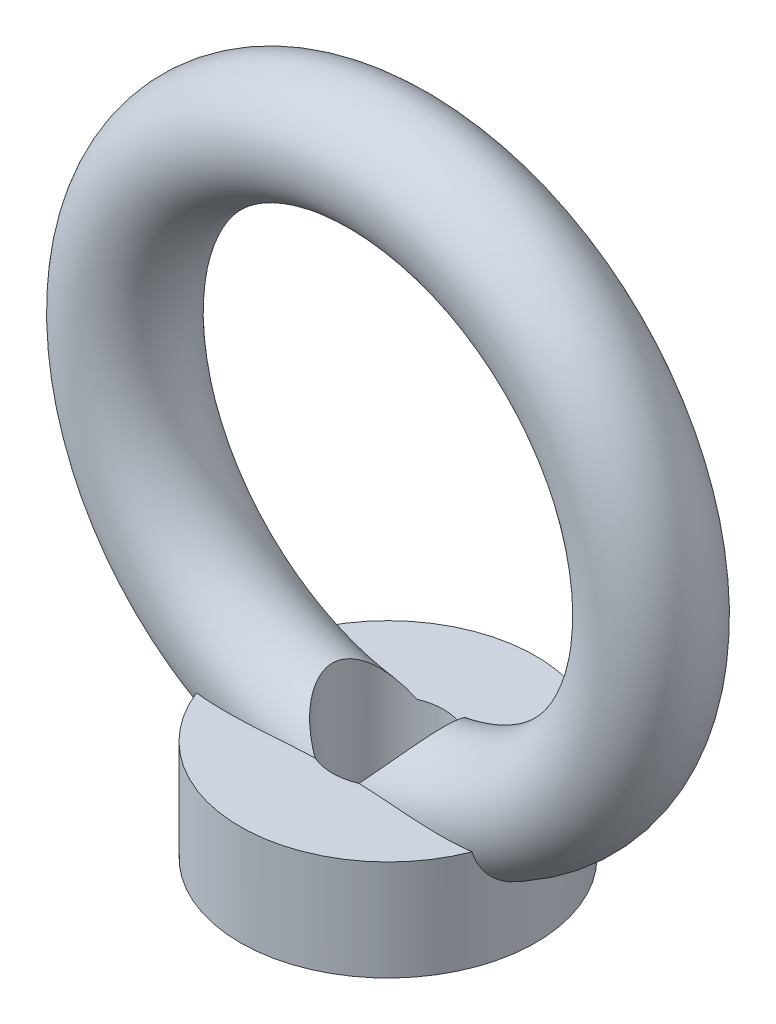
ISO-10303-21;
HEADER;
FILE_DESCRIPTION(('STEP AP214'),'2;1');
FILE_NAME('part.step','',(''),(''),'','','');
FILE_SCHEMA(('AUTOMOTIVE_DESIGN { 1 0 10303 214 1 1 1 1 }'));
ENDSEC;
DATA;
#1=APPLICATION_CONTEXT('core data for automotive mechanical design processes');
#2=APPLICATION_PROTOCOL_DEFINITION('international standard','automotive_design',2000,#1);
#3=PRODUCT_CONTEXT('',#1,'mechanical');
#4=PRODUCT('Part','Part','',(#3));
#5=PRODUCT_RELATED_PRODUCT_CATEGORY('part','',(#4));
#6=PRODUCT_DEFINITION_FORMATION('','',#4);
#7=PRODUCT_DEFINITION_CONTEXT('part definition',#1,'design');
#8=PRODUCT_DEFINITION('design','',#6,#7);
#9=PRODUCT_DEFINITION_SHAPE('','',#8);
#10=(LENGTH_UNIT() NAMED_UNIT(*) SI_UNIT(.MILLI.,.METRE.));
#11=(NAMED_UNIT(*) PLANE_ANGLE_UNIT() SI_UNIT($,.RADIAN.));
#12=(NAMED_UNIT(*) SI_UNIT($,.STERADIAN.) SOLID_ANGLE_UNIT());
#13=UNCERTAINTY_MEASURE_WITH_UNIT(LENGTH_MEASURE(1.E-05),#10,'distance_accuracy_value','');
#14=(GEOMETRIC_REPRESENTATION_CONTEXT(3) GLOBAL_UNCERTAINTY_ASSIGNED_CONTEXT((#13)) GLOBAL_UNIT_ASSIGNED_CONTEXT((#10,
#11,#12)) REPRESENTATION_CONTEXT('',''));
#15=CARTESIAN_POINT('',(0.,0.,0.));
#16=DIRECTION('',(0.,0.,1.));
#17=DIRECTION('',(1.,0.,0.));
#18=AXIS2_PLACEMENT_3D('',#15,#16,#17);
#19=CARTESIAN_POINT('',(0.,17.272,0.));
#20=DIRECTION('',(0.,1.,0.));
#21=DIRECTION('',(0.,0.,1.));
#22=AXIS2_PLACEMENT_3D('',#19,#20,#21);
#23=PLANE('',#22);
#24=CARTESIAN_POINT('',(0.,17.272,0.));
#25=DIRECTION('',(0.,1.,0.));
#26=DIRECTION('',(0.,0.,1.));
#27=AXIS2_PLACEMENT_3D('',#24,#25,#26);
#28=CIRCLE('',#27,9.525);
#29=CARTESIAN_POINT('',(3.75295136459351,17.272,-8.75448348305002));
#30=VERTEX_POINT('',#29);
#31=CARTESIAN_POINT('',(-3.75295136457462,17.272,-8.75448348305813));
#32=VERTEX_POINT('',#31);
#33=EDGE_CURVE('E401',#30,#32,#28,.T.);
#34=ORIENTED_EDGE('',*,*,#33,.F.);
#35=CARTESIAN_POINT('',(0.,17.272,8.67954019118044));
#36=CARTESIAN_POINT('',(0.395993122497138,17.272,8.679538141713));
#37=CARTESIAN_POINT('',(0.791984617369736,17.272,8.68212215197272));
#38=CARTESIAN_POINT('',(1.58390188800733,17.272,8.69236349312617));
#39=CARTESIAN_POINT('',(1.97982766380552,17.272,8.70002082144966));
#40=CARTESIAN_POINT('',(2.77156534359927,17.272,8.72014953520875));
#41=CARTESIAN_POINT('',(3.16737724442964,17.272,8.73262104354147));
#42=CARTESIAN_POINT('',(3.95883761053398,17.272,8.7619436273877));
#43=CARTESIAN_POINT('',(4.35448607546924,17.272,8.77879471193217));
#44=CARTESIAN_POINT('',(5.54184245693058,17.272,8.83512557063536));
#45=CARTESIAN_POINT('',(6.33327542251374,17.272,8.88036371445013));
#46=CARTESIAN_POINT('',(7.91552120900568,17.272,8.9801593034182));
#47=CARTESIAN_POINT('',(8.70633402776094,17.272,9.03471678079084));
#48=CARTESIAN_POINT('',(10.2926590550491,17.272,9.14600665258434));
#49=CARTESIAN_POINT('',(11.0881704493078,17.272,9.20275030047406));
#50=CARTESIAN_POINT('',(12.6797086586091,17.272,9.30960993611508));
#51=CARTESIAN_POINT('',(13.4757355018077,17.272,9.35972552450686));
#52=CARTESIAN_POINT('',(15.0678391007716,17.272,9.44415051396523));
#53=CARTESIAN_POINT('',(15.8639148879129,17.272,9.47847680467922));
#54=CARTESIAN_POINT('',(17.4566874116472,17.272,9.52167726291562));
#55=CARTESIAN_POINT('',(18.2533839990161,17.272,9.53055633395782));
#56=CARTESIAN_POINT('',(19.857317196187,17.272,9.51224237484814));
#57=CARTESIAN_POINT('',(20.664551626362,17.272,9.48456317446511));
#58=CARTESIAN_POINT('',(21.8733622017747,17.272,9.40618067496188));
#59=CARTESIAN_POINT('',(22.2761431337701,17.272,9.37388594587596));
#60=CARTESIAN_POINT('',(23.0803536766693,17.272,9.29529044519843));
#61=CARTESIAN_POINT('',(23.4817833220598,17.272,9.24899003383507));
#62=CARTESIAN_POINT('',(24.2795508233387,17.272,9.14098205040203));
#63=CARTESIAN_POINT('',(24.6759043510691,17.272,9.07939149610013));
#64=CARTESIAN_POINT('',(25.4655686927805,17.272,8.93871246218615));
#65=CARTESIAN_POINT('',(25.8588792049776,17.272,8.85962226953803));
#66=CARTESIAN_POINT('',(26.6405605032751,17.272,8.68199599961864));
#67=CARTESIAN_POINT('',(27.0289372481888,17.272,8.58348635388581));
#68=CARTESIAN_POINT('',(27.7994589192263,17.272,8.36474424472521));
#69=CARTESIAN_POINT('',(28.1816059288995,17.272,8.24451921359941));
#70=CARTESIAN_POINT('',(28.8293566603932,17.272,8.01777405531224));
#71=CARTESIAN_POINT('',(29.0970343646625,17.272,7.91716787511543));
#72=CARTESIAN_POINT('',(29.6270514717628,17.272,7.70271881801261));
#73=CARTESIAN_POINT('',(29.8893911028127,17.272,7.58887650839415));
#74=CARTESIAN_POINT('',(30.4078787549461,17.272,7.34681104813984));
#75=CARTESIAN_POINT('',(30.6640164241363,17.272,7.21856563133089));
#76=CARTESIAN_POINT('',(31.1681357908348,17.272,6.94686946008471));
#77=CARTESIAN_POINT('',(31.416117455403,17.272,6.80341864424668));
#78=CARTESIAN_POINT('',(31.9042184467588,17.272,6.49902405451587));
#79=CARTESIAN_POINT('',(32.1442483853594,17.272,6.33793623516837));
#80=CARTESIAN_POINT('',(32.6118248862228,17.272,5.99842444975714));
#81=CARTESIAN_POINT('',(32.8393701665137,17.272,5.81999870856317));
#82=CARTESIAN_POINT('',(33.2788199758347,17.272,5.44543822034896));
#83=CARTESIAN_POINT('',(33.4907493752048,17.272,5.2493327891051));
#84=CARTESIAN_POINT('',(33.8960745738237,17.272,4.83882661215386));
#85=CARTESIAN_POINT('',(34.0894779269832,17.272,4.62443339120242));
#86=CARTESIAN_POINT('',(34.4011791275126,17.272,4.24231888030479));
#87=CARTESIAN_POINT('',(34.5249964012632,17.272,4.07908470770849));
#88=CARTESIAN_POINT('',(34.7599555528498,17.272,3.74375452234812));
#89=CARTESIAN_POINT('',(34.8711007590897,17.272,3.57166085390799));
#90=CARTESIAN_POINT('',(35.0792206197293,17.272,3.21908392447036));
#91=CARTESIAN_POINT('',(35.1761954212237,17.272,3.03860075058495));
#92=CARTESIAN_POINT('',(35.3544095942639,17.272,2.67010546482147));
#93=CARTESIAN_POINT('',(35.4356566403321,17.272,2.48209707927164));
#94=CARTESIAN_POINT('',(35.581656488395,17.272,2.09789034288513));
#95=CARTESIAN_POINT('',(35.6462605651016,17.272,1.90163522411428));
#96=CARTESIAN_POINT('',(35.7567467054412,17.272,1.50390020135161));
#97=CARTESIAN_POINT('',(35.8026286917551,17.272,1.30242027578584));
#98=CARTESIAN_POINT('',(35.8746464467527,17.272,0.896070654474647));
#99=CARTESIAN_POINT('',(35.9007938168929,17.272,0.691203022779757));
#100=CARTESIAN_POINT('',(35.9327789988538,17.272,0.279896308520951));
#101=CARTESIAN_POINT('',(35.9386192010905,17.272,0.0734574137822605));
#102=CARTESIAN_POINT('',(35.9303969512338,17.272,-0.313981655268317));
#103=CARTESIAN_POINT('',(35.9186588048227,17.272,-0.495035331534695));
#104=CARTESIAN_POINT('',(35.8796179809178,17.272,-0.855457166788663));
#105=CARTESIAN_POINT('',(35.8523153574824,17.272,-1.03482533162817));
#106=CARTESIAN_POINT('',(35.7826240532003,17.272,-1.39059712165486));
#107=CARTESIAN_POINT('',(35.7402351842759,17.272,-1.56700070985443));
#108=CARTESIAN_POINT('',(35.6410798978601,17.272,-1.91571193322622));
#109=CARTESIAN_POINT('',(35.5843128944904,17.272,-2.08801940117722));
#110=CARTESIAN_POINT('',(35.4574833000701,17.272,-2.42702001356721));
#111=CARTESIAN_POINT('',(35.3874647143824,17.272,-2.59372964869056));
#112=CARTESIAN_POINT('',(35.2349967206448,17.272,-2.92138279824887));
#113=CARTESIAN_POINT('',(35.1525429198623,17.272,-3.08232425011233));
#114=CARTESIAN_POINT('',(34.8880983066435,17.272,-3.55548769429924));
#115=CARTESIAN_POINT('',(34.6889330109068,17.272,-3.85828708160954));
#116=CARTESIAN_POINT('',(34.3083333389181,17.272,-4.36273545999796));
#117=CARTESIAN_POINT('',(34.1350268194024,17.272,-4.57067752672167));
#118=CARTESIAN_POINT('',(33.7707292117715,17.272,-4.970535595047));
#119=CARTESIAN_POINT('',(33.5797311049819,17.272,-5.16244517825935));
#120=CARTESIAN_POINT('',(32.9835986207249,17.272,-5.71506180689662));
#121=CARTESIAN_POINT('',(32.5560048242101,17.272,-6.05178814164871));
#122=CARTESIAN_POINT('',(31.7702408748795,17.272,-6.58986002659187));
#123=CARTESIAN_POINT('',(31.4206365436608,17.272,-6.80418114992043));
#124=CARTESIAN_POINT('',(30.7038259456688,17.272,-7.20148686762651));
#125=CARTESIAN_POINT('',(30.3366106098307,17.272,-7.38445508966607));
#126=CARTESIAN_POINT('',(29.5898252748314,17.272,-7.721456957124));
#127=CARTESIAN_POINT('',(29.2102707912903,17.272,-7.87552540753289));
#128=CARTESIAN_POINT('',(28.4417631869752,17.272,-8.15779886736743));
#129=CARTESIAN_POINT('',(28.0528107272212,17.272,-8.28600568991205));
#130=CARTESIAN_POINT('',(27.3027865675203,17.272,-8.5088592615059));
#131=CARTESIAN_POINT('',(26.9422921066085,17.272,-8.60547148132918));
#132=CARTESIAN_POINT('',(26.2170311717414,17.272,-8.78124756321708));
#133=CARTESIAN_POINT('',(25.8522639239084,17.272,-8.86040821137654));
#134=CARTESIAN_POINT('',(25.1194744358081,17.272,-9.00301266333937));
#135=CARTESIAN_POINT('',(24.7514504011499,17.272,-9.06644716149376));
#136=CARTESIAN_POINT('',(24.0132320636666,17.272,-9.17913514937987));
#137=CARTESIAN_POINT('',(23.6430376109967,17.272,-9.22838764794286));
#138=CARTESIAN_POINT('',(22.8985573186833,17.272,-9.31449034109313));
#139=CARTESIAN_POINT('',(22.5242611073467,17.272,-9.35124982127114));
#140=CARTESIAN_POINT('',(21.7747082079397,17.272,-9.41329040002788));
#141=CARTESIAN_POINT('',(21.3994514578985,17.272,-9.43857073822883));
#142=CARTESIAN_POINT('',(20.6485167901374,17.272,-9.4789639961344));
#143=CARTESIAN_POINT('',(20.2728390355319,17.272,-9.49408001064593));
#144=CARTESIAN_POINT('',(19.5213202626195,17.272,-9.51539253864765));
#145=CARTESIAN_POINT('',(19.1454792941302,17.272,-9.52159089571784));
#146=CARTESIAN_POINT('',(17.8907403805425,17.272,-9.52939304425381));
#147=CARTESIAN_POINT('',(17.0117339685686,17.272,-9.51374705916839));
#148=CARTESIAN_POINT('',(15.254639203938,17.272,-9.45419302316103));
#149=CARTESIAN_POINT('',(14.3765511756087,17.272,-9.41027709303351));
#150=CARTESIAN_POINT('',(12.6202003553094,17.272,-9.30690412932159));
#151=CARTESIAN_POINT('',(11.7419388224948,17.272,-9.24742694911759));
#152=CARTESIAN_POINT('',(9.98575416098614,17.272,-9.1249547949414));
#153=CARTESIAN_POINT('',(9.10783100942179,17.272,-9.06196012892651));
#154=CARTESIAN_POINT('',(7.79000939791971,17.272,-8.97293040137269));
#155=CARTESIAN_POINT('',(7.35030254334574,17.272,-8.94414782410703));
#156=CARTESIAN_POINT('',(6.47070202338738,17.272,-8.88961917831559));
#157=CARTESIAN_POINT('',(6.03080835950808,17.272,-8.86387308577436));
#158=CARTESIAN_POINT('',(5.15079927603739,17.272,-8.81650267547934));
#159=CARTESIAN_POINT('',(4.71068385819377,17.272,-8.79487832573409));
#160=CARTESIAN_POINT('',(3.83023226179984,17.272,-8.75665857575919));
#161=CARTESIAN_POINT('',(3.38989608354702,17.272,-8.74006316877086));
#162=CARTESIAN_POINT('',(2.50971974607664,17.272,-8.71262406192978));
#163=CARTESIAN_POINT('',(2.06987986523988,17.272,-8.70177155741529));
#164=CARTESIAN_POINT('',(1.19008986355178,17.272,-8.68623955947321));
#165=CARTESIAN_POINT('',(0.750139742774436,17.272,-8.68156006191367));
#166=CARTESIAN_POINT('',(-0.129776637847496,17.272,-8.6785733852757));
#167=CARTESIAN_POINT('',(-0.56974289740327,17.272,-8.6802661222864));
#168=CARTESIAN_POINT('',(-1.44960526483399,17.272,-8.68995159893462));
#169=CARTESIAN_POINT('',(-1.88950137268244,17.272,-8.69794434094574));
#170=CARTESIAN_POINT('',(-2.76556387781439,17.272,-8.71980074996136));
#171=CARTESIAN_POINT('',(-3.20173149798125,17.272,-8.7336161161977));
#172=CARTESIAN_POINT('',(-4.07386483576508,17.272,-8.76653540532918));
#173=CARTESIAN_POINT('',(-4.50983055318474,17.272,-8.78563933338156));
#174=CARTESIAN_POINT('',(-5.38155816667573,17.272,-8.82834892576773));
#175=CARTESIAN_POINT('',(-5.81732005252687,17.272,-8.8519547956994));
#176=CARTESIAN_POINT('',(-6.68864023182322,17.272,-8.90269079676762));
#177=CARTESIAN_POINT('',(-7.12419852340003,17.272,-8.92982095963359));
#178=CARTESIAN_POINT('',(-8.43261583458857,17.272,-9.01497907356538));
#179=CARTESIAN_POINT('',(-9.30523042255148,17.272,-9.07666757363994));
#180=CARTESIAN_POINT('',(-11.0504541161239,17.272,-9.19948631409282));
#181=CARTESIAN_POINT('',(-11.9230632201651,17.272,-9.2606165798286));
#182=CARTESIAN_POINT('',(-13.664798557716,17.272,-9.37052416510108));
#183=CARTESIAN_POINT('',(-14.533920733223,17.272,-9.41936094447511));
#184=CARTESIAN_POINT('',(-16.2734686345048,17.272,-9.492886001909));
#185=CARTESIAN_POINT('',(-17.1438946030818,17.272,-9.51756901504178));
#186=CARTESIAN_POINT('',(-18.8827888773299,17.272,-9.52957879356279));
#187=CARTESIAN_POINT('',(-19.7512556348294,17.272,-9.51701253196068));
#188=CARTESIAN_POINT('',(-21.0520215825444,17.272,-9.45944076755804));
#189=CARTESIAN_POINT('',(-21.4851842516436,17.272,-9.43380723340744));
#190=CARTESIAN_POINT('',(-22.3503504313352,17.272,-9.36763062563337));
#191=CARTESIAN_POINT('',(-22.7823540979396,17.272,-9.327089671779));
#192=CARTESIAN_POINT('',(-23.4606442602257,17.272,-9.24987971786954));
#193=CARTESIAN_POINT('',(-23.7075886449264,17.272,-9.21892845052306));
#194=CARTESIAN_POINT('',(-24.2007042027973,17.272,-9.15097312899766));
#195=CARTESIAN_POINT('',(-24.4468751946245,17.272,-9.11396774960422));
#196=CARTESIAN_POINT('',(-24.9383815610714,17.272,-9.03342070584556));
#197=CARTESIAN_POINT('',(-25.1837159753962,17.272,-8.98987314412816));
#198=CARTESIAN_POINT('',(-25.6730251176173,17.272,-8.89579219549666));
#199=CARTESIAN_POINT('',(-25.9169999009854,17.272,-8.84525909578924));
#200=CARTESIAN_POINT('',(-26.6448251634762,17.272,-8.68279163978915));
#201=CARTESIAN_POINT('',(-27.1262623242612,17.272,-8.55972012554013));
#202=CARTESIAN_POINT('',(-28.0790340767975,17.272,-8.27962116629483));
#203=CARTESIAN_POINT('',(-28.5503739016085,17.272,-8.12261180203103));
#204=CARTESIAN_POINT('',(-29.3428431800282,17.272,-7.82146866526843));
#205=CARTESIAN_POINT('',(-29.6676338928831,17.272,-7.68696993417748));
#206=CARTESIAN_POINT('',(-30.307619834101,17.272,-7.39686230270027));
#207=CARTESIAN_POINT('',(-30.6228176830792,17.272,-7.24125923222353));
#208=CARTESIAN_POINT('',(-31.2410900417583,17.272,-6.90703519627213));
#209=CARTESIAN_POINT('',(-31.5441568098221,17.272,-6.72839982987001));
#210=CARTESIAN_POINT('',(-32.1343498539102,17.272,-6.34649271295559));
#211=CARTESIAN_POINT('',(-32.4214825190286,17.272,-6.14323094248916));
#212=CARTESIAN_POINT('',(-32.8914110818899,17.272,-5.77619795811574));
#213=CARTESIAN_POINT('',(-33.0794544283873,17.272,-5.61912864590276));
#214=CARTESIAN_POINT('',(-33.4439250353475,17.272,-5.29188894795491));
#215=CARTESIAN_POINT('',(-33.6203494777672,17.272,-5.12171540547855));
#216=CARTESIAN_POINT('',(-33.959197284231,17.272,-4.76841578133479));
#217=CARTESIAN_POINT('',(-34.1216417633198,17.272,-4.58531002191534));
#218=CARTESIAN_POINT('',(-34.4304521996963,17.272,-4.20611822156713));
#219=CARTESIAN_POINT('',(-34.5768282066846,17.272,-4.01004041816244));
#220=CARTESIAN_POINT('',(-34.8248074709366,17.272,-3.64413016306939));
#221=CARTESIAN_POINT('',(-34.9296156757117,17.272,-3.47646708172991));
#222=CARTESIAN_POINT('',(-35.1257466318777,17.272,-3.13350424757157));
#223=CARTESIAN_POINT('',(-35.2170759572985,17.272,-2.95820827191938));
#224=CARTESIAN_POINT('',(-35.3849414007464,17.272,-2.60064297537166));
#225=CARTESIAN_POINT('',(-35.4614771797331,17.272,-2.41837349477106));
#226=CARTESIAN_POINT('',(-35.5984688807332,17.272,-2.04786375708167));
#227=CARTESIAN_POINT('',(-35.6589246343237,17.272,-1.8596234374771));
#228=CARTESIAN_POINT('',(-35.7629673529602,17.272,-1.47721001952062));
#229=CARTESIAN_POINT('',(-35.8064427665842,17.272,-1.28300643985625));
#230=CARTESIAN_POINT('',(-35.8750817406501,17.272,-0.891375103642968));
#231=CARTESIAN_POINT('',(-35.9002452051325,17.272,-0.693947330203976));
#232=CARTESIAN_POINT('',(-35.9317156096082,17.272,-0.297662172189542));
#233=CARTESIAN_POINT('',(-35.9380294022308,17.272,-0.0988053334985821));
#234=CARTESIAN_POINT('',(-35.9316791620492,17.272,0.298594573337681));
#235=CARTESIAN_POINT('',(-35.9190166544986,17.272,0.497137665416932));
#236=CARTESIAN_POINT('',(-35.8773115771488,17.272,0.871381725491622));
#237=CARTESIAN_POINT('',(-35.8501274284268,17.272,1.04729325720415));
#238=CARTESIAN_POINT('',(-35.7812376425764,17.272,1.39630637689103));
#239=CARTESIAN_POINT('',(-35.7395271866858,17.272,1.56940701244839));
#240=CARTESIAN_POINT('',(-35.6422723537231,17.272,1.91160146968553));
#241=CARTESIAN_POINT('',(-35.5867325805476,17.272,2.08069660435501));
#242=CARTESIAN_POINT('',(-35.4626216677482,17.272,2.41408939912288));
#243=CARTESIAN_POINT('',(-35.3940456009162,17.272,2.57838521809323));
#244=CARTESIAN_POINT('',(-35.2416858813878,17.272,2.90813356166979));
#245=CARTESIAN_POINT('',(-35.1573866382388,17.272,3.07334772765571));
#246=CARTESIAN_POINT('',(-34.9767841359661,17.272,3.39710493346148));
#247=CARTESIAN_POINT('',(-34.8804762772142,17.272,3.55564538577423));
#248=CARTESIAN_POINT('',(-34.5752172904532,17.272,4.02054368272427));
#249=CARTESIAN_POINT('',(-34.3498711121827,17.272,4.31630472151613));
#250=CARTESIAN_POINT('',(-33.9166619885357,17.272,4.81706227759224));
#251=CARTESIAN_POINT('',(-33.7154120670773,17.272,5.02792205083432));
#252=CARTESIAN_POINT('',(-33.2950224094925,17.272,5.43116882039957));
#253=CARTESIAN_POINT('',(-33.0758745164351,17.272,5.62354730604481));
#254=CARTESIAN_POINT('',(-32.6225139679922,17.272,5.99055428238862));
#255=CARTESIAN_POINT('',(-32.3882704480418,17.272,6.16514439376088));
#256=CARTESIAN_POINT('',(-31.9078442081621,17.272,6.49690963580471));
#257=CARTESIAN_POINT('',(-31.6616617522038,17.272,6.6540851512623));
#258=CARTESIAN_POINT('',(-31.0199644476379,17.272,7.03482443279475));
#259=CARTESIAN_POINT('',(-30.6175083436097,17.272,7.24672566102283));
#260=CARTESIAN_POINT('',(-29.7956097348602,17.272,7.63458472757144));
#261=CARTESIAN_POINT('',(-29.3761570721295,17.272,7.81052067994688));
#262=CARTESIAN_POINT('',(-28.5249569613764,17.272,8.130279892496));
#263=CARTESIAN_POINT('',(-28.0932011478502,17.272,8.27408068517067));
#264=CARTESIAN_POINT('',(-27.2213801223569,17.272,8.53297075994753));
#265=CARTESIAN_POINT('',(-26.7813167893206,17.272,8.6480664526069));
#266=CARTESIAN_POINT('',(-25.7930508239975,17.272,8.87658220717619));
#267=CARTESIAN_POINT('',(-25.2433479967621,17.272,8.98347486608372));
#268=CARTESIAN_POINT('',(-24.1384750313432,17.272,9.16447620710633));
#269=CARTESIAN_POINT('',(-23.5833026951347,17.272,9.23857110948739));
#270=CARTESIAN_POINT('',(-22.4691057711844,17.272,9.35901348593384));
#271=CARTESIAN_POINT('',(-21.9100763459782,17.272,9.40531507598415));
#272=CARTESIAN_POINT('',(-20.7907050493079,17.272,9.4745027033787));
#273=CARTESIAN_POINT('',(-20.2303633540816,17.272,9.4973917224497));
#274=CARTESIAN_POINT('',(-19.1055339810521,17.272,9.52398256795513));
#275=CARTESIAN_POINT('',(-18.5410435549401,17.272,9.52755553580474));
#276=CARTESIAN_POINT('',(-17.4121988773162,17.272,9.51906184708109));
#277=CARTESIAN_POINT('',(-16.8478446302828,17.272,9.50699473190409));
#278=CARTESIAN_POINT('',(-15.7200031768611,17.272,9.47088121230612));
#279=CARTESIAN_POINT('',(-15.1565156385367,17.272,9.4468445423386));
#280=CARTESIAN_POINT('',(-14.0299617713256,17.272,9.39024088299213));
#281=CARTESIAN_POINT('',(-13.4668954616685,17.272,9.35767352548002));
#282=CARTESIAN_POINT('',(-12.3648175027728,17.272,9.28877773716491));
#283=CARTESIAN_POINT('',(-11.8257919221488,17.272,9.2526655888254));
#284=CARTESIAN_POINT('',(-10.7478939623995,17.272,9.17838974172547));
#285=CARTESIAN_POINT('',(-10.209021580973,17.272,9.14022607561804));
#286=CARTESIAN_POINT('',(-9.13113317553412,17.272,9.06445752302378));
#287=CARTESIAN_POINT('',(-8.59211714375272,17.272,9.02685274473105));
#288=CARTESIAN_POINT('',(-7.51388088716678,17.272,8.9546467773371));
#289=CARTESIAN_POINT('',(-6.97466066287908,17.272,8.92004558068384));
#290=CARTESIAN_POINT('',(-5.89948907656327,17.272,8.85624756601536));
#291=CARTESIAN_POINT('',(-5.36353979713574,17.272,8.82701637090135));
#292=CARTESIAN_POINT('',(-4.29130256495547,17.272,8.77549353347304));
#293=CARTESIAN_POINT('',(-3.75501461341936,17.272,8.75320186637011));
#294=CARTESIAN_POINT('',(-2.6823539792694,17.272,8.71695668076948));
#295=CARTESIAN_POINT('',(-2.14598140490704,17.272,8.70300002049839));
#296=CARTESIAN_POINT('',(-1.07307155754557,17.272,8.68429317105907));
#297=CARTESIAN_POINT('',(-0.536534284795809,17.272,8.67954296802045));
#298=CARTESIAN_POINT('',(0.,17.272,8.67954019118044));
#299=B_SPLINE_CURVE_WITH_KNOTS('',3,(#35,#36,#37,#38,#39,#40,#41,#42,#43,#44,#45,#46,#47,#48,
#49,#50,#51,#52,#53,#54,#55,#56,#57,#58,#59,#60,#61,#62,#63,#64,#65,#66,#67,#68,#69,#70,#71,#72,
#73,#74,#75,#76,#77,#78,#79,#80,#81,#82,#83,#84,#85,#86,#87,#88,#89,#90,#91,#92,#93,#94,#95,#96,
#97,#98,#99,#100,#101,#102,#103,#104,#105,#106,#107,#108,#109,#110,#111,#112,#113,#114,#115,
#116,#117,#118,#119,#120,#121,#122,#123,#124,#125,#126,#127,#128,#129,#130,#131,#132,#133,#134,
#135,#136,#137,#138,#139,#140,#141,#142,#143,#144,#145,#146,#147,#148,#149,#150,#151,#152,#153,
#154,#155,#156,#157,#158,#159,#160,#161,#162,#163,#164,#165,#166,#167,#168,#169,#170,#171,#172,
#173,#174,#175,#176,#177,#178,#179,#180,#181,#182,#183,#184,#185,#186,#187,#188,#189,#190,#191,
#192,#193,#194,#195,#196,#197,#198,#199,#200,#201,#202,#203,#204,#205,#206,#207,#208,#209,#210,
#211,#212,#213,#214,#215,#216,#217,#218,#219,#220,#221,#222,#223,#224,#225,#226,#227,#228,#229,
#230,#231,#232,#233,#234,#235,#236,#237,#238,#239,#240,#241,#242,#243,#244,#245,#246,#247,#248,
#249,#250,#251,#252,#253,#254,#255,#256,#257,#258,#259,#260,#261,#262,#263,#264,#265,#266,#267,
#268,#269,#270,#271,#272,#273,#274,#275,#276,#277,#278,#279,#280,#281,#282,#283,#284,#285,#286,
#287,#288,#289,#290,#291,#292,#293,#294,#295,#296,#297,#298),.UNSPECIFIED.,.T.,.F.,(4,2,2,2,2,2,
2,2,2,2,2,2,2,2,2,2,2,2,2,2,2,2,2,2,2,2,2,2,2,2,2,2,2,2,2,2,2,2,2,2,2,2,2,2,2,2,2,2,2,2,2,2,2,2,
2,2,2,2,2,2,2,2,2,2,2,2,2,2,2,2,2,2,2,2,2,2,2,2,2,2,2,2,2,2,2,2,2,2,2,2,2,2,2,2,2,2,2,2,2,2,2,2,
2,2,2,2,2,2,2,2,2,2,2,2,2,2,2,2,2,2,2,2,2,2,2,2,2,2,2,2,2,4),(0.,1.18796832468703,
2.37593604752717,3.56393409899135,4.75193460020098,7.12999381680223,9.50806125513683,
11.900661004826,14.2934048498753,16.6835832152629,19.0733009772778,21.4951205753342,
22.7071425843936,23.9191334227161,25.1221201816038,26.3252247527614,27.5267029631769,
28.7277707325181,29.5853413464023,30.4428752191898,31.3017535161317,32.1606352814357,
33.0271450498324,33.8937436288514,34.7589307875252,35.6237636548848,36.2378895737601,
36.8518538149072,37.4658116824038,38.0794692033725,38.6984338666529,39.3174010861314,
39.9360041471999,40.5545343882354,41.0981692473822,41.64180221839,42.1854419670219,
42.7291038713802,43.2709911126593,43.8130702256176,44.8964702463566,45.7075327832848,
46.5189184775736,48.1449557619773,49.3736803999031,50.6030447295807,51.8309188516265,
53.0587068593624,54.1778862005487,55.2972714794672,56.4173175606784,57.5374419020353,
58.665534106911,59.7937010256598,60.9215242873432,62.0491143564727,64.6857220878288,
67.3230649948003,69.9638394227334,72.6043830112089,73.9263186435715,75.2482438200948,
76.5701587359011,77.8920718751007,79.2119524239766,80.5318320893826,81.8516943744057,
83.1715571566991,84.4806802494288,85.7898046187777,87.0989887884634,88.4081847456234,
91.0325454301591,93.6567863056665,96.2680794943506,98.8799417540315,101.484310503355,
102.785870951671,104.087246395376,104.833812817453,105.580542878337,106.327950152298,
107.07532670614,108.564966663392,110.053814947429,111.107778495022,112.161451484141,
113.215786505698,114.26969566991,115.004191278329,115.738864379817,116.472407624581,
117.205489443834,117.7981149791,118.390450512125,118.982799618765,119.575154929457,
120.171338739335,120.767525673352,121.363495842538,121.959418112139,122.49280264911,
123.02636429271,123.559748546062,124.093334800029,124.649209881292,125.205298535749,
126.317060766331,127.190421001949,128.064181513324,128.939788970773,129.815377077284,
131.177677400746,132.540804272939,133.904881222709,135.268653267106,136.947424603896,
138.626900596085,140.309141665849,141.991168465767,143.684402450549,145.377686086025,
147.06959487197,148.761576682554,150.382269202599,152.002935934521,153.623912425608,
155.244884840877,156.855088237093,158.46528588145,160.074876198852,161.684464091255),.UNSPECIFIED.);
#300=CARTESIAN_POINT('',(23.6662597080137,17.272,-9.22323974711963));
#301=VERTEX_POINT('',#300);
#302=EDGE_CURVE('E432',#301,#30,#299,.T.);
#303=ORIENTED_EDGE('',*,*,#302,.F.);
#304=CARTESIAN_POINT('',(0.,17.272,0.));
#305=DIRECTION('',(0.,1.,0.));
#306=DIRECTION('',(0.,0.,1.));
#307=AXIS2_PLACEMENT_3D('',#304,#305,#306);
#308=CIRCLE('',#307,25.4);
#309=CARTESIAN_POINT('',(-23.6662597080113,17.272,-9.22323974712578));
#310=VERTEX_POINT('',#309);
#311=EDGE_CURVE('E444',#301,#310,#308,.T.);
#312=ORIENTED_EDGE('',*,*,#311,.T.);
#313=EDGE_CURVE('E442',#32,#310,#299,.T.);
#314=ORIENTED_EDGE('',*,*,#313,.F.);
#315=EDGE_LOOP('',(#34,#303,#312,#314));
#316=FACE_BOUND('',#315,.T.);
#317=ADVANCED_FACE('F381',(#316),#23,.T.);
#318=CARTESIAN_POINT('',(0.,17.272,0.));
#319=DIRECTION('',(0.,-1.,0.));
#320=DIRECTION('',(0.,0.,-1.));
#321=AXIS2_PLACEMENT_3D('',#318,#319,#320);
#322=CYLINDRICAL_SURFACE('',#321,25.4);
#323=ORIENTED_EDGE('',*,*,#311,.F.);
#324=CARTESIAN_POINT('',(23.6662413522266,17.2722,-9.22328684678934));
#325=CARTESIAN_POINT('',(23.6896815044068,17.016270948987,-9.16306871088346));
#326=CARTESIAN_POINT('',(23.7166306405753,16.7628526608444,-9.09330976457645));
#327=CARTESIAN_POINT('',(23.7769347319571,16.26283614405,-8.93448123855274));
#328=CARTESIAN_POINT('',(23.8102918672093,16.0162402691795,-8.84540508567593));
#329=CARTESIAN_POINT('',(23.8827659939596,15.5319576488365,-8.64780022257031));
#330=CARTESIAN_POINT('',(23.9218802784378,15.2942667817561,-8.53928064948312));
#331=CARTESIAN_POINT('',(24.0049212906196,14.8295772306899,-8.30297844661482));
#332=CARTESIAN_POINT('',(24.0488473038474,14.6025769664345,-8.17519867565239));
#333=CARTESIAN_POINT('',(24.1404813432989,14.1604281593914,-7.90051606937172));
#334=CARTESIAN_POINT('',(24.1881987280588,13.9453113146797,-7.75356530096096));
#335=CARTESIAN_POINT('',(24.2859871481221,13.5291655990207,-7.44160839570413));
#336=CARTESIAN_POINT('',(24.3360581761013,13.3281366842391,-7.2766023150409));
#337=CARTESIAN_POINT('',(24.4370958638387,12.9416913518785,-6.92971476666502));
#338=CARTESIAN_POINT('',(24.4880619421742,12.7562652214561,-6.74784394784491));
#339=CARTESIAN_POINT('',(24.5894643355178,12.4020737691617,-6.36842131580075));
#340=CARTESIAN_POINT('',(24.6399006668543,12.2333079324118,-6.17086998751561));
#341=CARTESIAN_POINT('',(24.7375348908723,11.9175620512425,-5.76683866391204));
#342=CARTESIAN_POINT('',(24.784782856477,11.7701303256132,-5.56072338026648));
#343=CARTESIAN_POINT('',(24.8761793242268,11.492725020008,-5.13641807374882));
#344=CARTESIAN_POINT('',(24.9203278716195,11.3627511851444,-4.91822822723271));
#345=CARTESIAN_POINT('',(25.0044022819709,11.1207940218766,-4.47119769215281));
#346=CARTESIAN_POINT('',(25.0443263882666,11.0088181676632,-4.24235262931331));
#347=CARTESIAN_POINT('',(25.1189199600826,10.8033800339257,-3.77567180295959));
#348=CARTESIAN_POINT('',(25.1535893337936,10.7099180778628,-3.53783588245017));
#349=CARTESIAN_POINT('',(25.2173879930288,10.5403297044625,-3.05038562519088));
#350=CARTESIAN_POINT('',(25.2464045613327,10.464550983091,-2.80063551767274));
#351=CARTESIAN_POINT('',(25.2973582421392,10.3328407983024,-2.29524925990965));
#352=CARTESIAN_POINT('',(25.3192952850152,10.2769095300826,-2.0396130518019));
#353=CARTESIAN_POINT('',(25.3555391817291,10.1850957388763,-1.52425447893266));
#354=CARTESIAN_POINT('',(25.3698466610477,10.1492115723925,-1.26453245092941));
#355=CARTESIAN_POINT('',(25.3904794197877,10.097607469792,-0.742778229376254));
#356=CARTESIAN_POINT('',(25.3968046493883,10.08188765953,-0.480746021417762));
#357=CARTESIAN_POINT('',(25.401346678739,10.0705902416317,0.0473478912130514));
#358=CARTESIAN_POINT('',(25.3994534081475,10.0752860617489,0.31341643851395));
#359=CARTESIAN_POINT('',(25.3873554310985,10.1054265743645,0.84418795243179));
#360=CARTESIAN_POINT('',(25.3771506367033,10.130871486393,1.10889090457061));
#361=CARTESIAN_POINT('',(25.34868715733,10.2024258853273,1.63508068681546));
#362=CARTESIAN_POINT('',(25.3304276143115,10.2485375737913,1.89656717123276));
#363=CARTESIAN_POINT('',(25.2863214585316,10.3612619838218,2.41443193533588));
#364=CARTESIAN_POINT('',(25.2604748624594,10.4278746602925,2.67081022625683));
#365=CARTESIAN_POINT('',(25.2018298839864,10.581441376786,3.17690725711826));
#366=CARTESIAN_POINT('',(25.1690236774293,10.6684183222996,3.42661814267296));
#367=CARTESIAN_POINT('',(25.0973401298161,10.8623315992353,3.91726840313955));
#368=CARTESIAN_POINT('',(25.058462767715,10.969267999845,4.15820774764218));
#369=CARTESIAN_POINT('',(24.9756847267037,11.2026325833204,4.62951576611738));
#370=CARTESIAN_POINT('',(24.9317847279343,11.329058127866,4.85988586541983));
#371=CARTESIAN_POINT('',(24.8401585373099,11.6008278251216,5.30838161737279));
#372=CARTESIAN_POINT('',(24.792432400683,11.7461717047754,5.52650744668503));
#373=CARTESIAN_POINT('',(24.6950195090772,12.0533605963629,5.94659626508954));
#374=CARTESIAN_POINT('',(24.6453596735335,12.2150092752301,6.14870905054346));
#375=CARTESIAN_POINT('',(24.5449843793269,12.5552018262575,6.53790010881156));
#376=CARTESIAN_POINT('',(24.4942689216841,12.7337456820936,6.72497839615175));
#377=CARTESIAN_POINT('',(24.3932081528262,13.1066585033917,7.08279424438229));
#378=CARTESIAN_POINT('',(24.3428628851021,13.3010292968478,7.25352991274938));
#379=CARTESIAN_POINT('',(24.2439756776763,13.7042665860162,7.57748888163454));
#380=CARTESIAN_POINT('',(24.1954336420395,13.9131323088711,7.73071311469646));
#381=CARTESIAN_POINT('',(24.1024458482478,14.3395381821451,8.01586890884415));
#382=CARTESIAN_POINT('',(24.05793752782,14.5568208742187,8.14816541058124));
#383=CARTESIAN_POINT('',(23.9730923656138,15.0023039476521,8.39451174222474));
#384=CARTESIAN_POINT('',(23.9327560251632,15.23050563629,8.50855938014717));
#385=CARTESIAN_POINT('',(23.8572870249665,15.6957224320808,8.71792561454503));
#386=CARTESIAN_POINT('',(23.8221465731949,15.9327236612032,8.81327232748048));
#387=CARTESIAN_POINT('',(23.7577503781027,16.414032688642,8.98541880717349));
#388=CARTESIAN_POINT('',(23.7284915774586,16.6583366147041,9.0622282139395));
#389=CARTESIAN_POINT('',(23.6959987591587,16.96622701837,9.1465815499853));
#390=CARTESIAN_POINT('',(23.6897710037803,17.027237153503,9.16269751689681));
#391=CARTESIAN_POINT('',(23.6777109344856,17.1495147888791,9.19381780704));
#392=CARTESIAN_POINT('',(23.6718782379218,17.2107819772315,9.20882320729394));
#393=CARTESIAN_POINT('',(23.6662413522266,17.2722,9.22328684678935));
#394=B_SPLINE_CURVE_WITH_KNOTS('',3,(#324,#325,#326,#327,#328,#329,#330,#331,#332,#333,#334,
#335,#336,#337,#338,#339,#340,#341,#342,#343,#344,#345,#346,#347,#348,#349,#350,#351,#352,#353,
#354,#355,#356,#357,#358,#359,#360,#361,#362,#363,#364,#365,#366,#367,#368,#369,#370,#371,#372,
#373,#374,#375,#376,#377,#378,#379,#380,#381,#382,#383,#384,#385,#386,#387,#388,#389,#390,#391,
#392,#393),.UNSPECIFIED.,.F.,.F.,(4,2,2,2,2,2,2,2,2,2,2,2,2,2,2,2,2,2,2,2,2,2,2,2,2,2,2,2,2,2,2,
2,2,2,4),(0.,0.791758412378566,1.58378666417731,2.37544368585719,3.16698331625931,
3.96054137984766,4.75409697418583,5.54715486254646,6.3401882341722,7.11264316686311,
7.88508682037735,8.65785042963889,9.43062753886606,10.217515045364,11.0044102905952,
11.7912410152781,12.5780766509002,13.3754826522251,14.1728970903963,14.9703964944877,
15.767894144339,16.5662931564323,17.3646949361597,18.1629887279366,18.9612709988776,
19.7508843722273,20.5404969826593,21.3302009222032,22.1198627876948,22.8937117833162,
23.6676536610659,24.440422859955,25.2127893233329,25.4030112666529,25.5930462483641),.UNSPECIFIED.);
#395=CARTESIAN_POINT('',(23.6662597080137,17.272,9.22323974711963));
#396=VERTEX_POINT('',#395);
#397=EDGE_CURVE('E452',#301,#396,#394,.T.);
#398=ORIENTED_EDGE('',*,*,#397,.T.);
#399=CARTESIAN_POINT('',(-23.6662597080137,17.272,9.22323974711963));
#400=VERTEX_POINT('',#399);
#401=EDGE_CURVE('E458',#400,#396,#308,.T.);
#402=ORIENTED_EDGE('',*,*,#401,.F.);
#403=CARTESIAN_POINT('',(-23.6662413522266,17.2722,9.22328684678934));
#404=CARTESIAN_POINT('',(-23.6896815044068,17.016270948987,9.16306871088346));
#405=CARTESIAN_POINT('',(-23.7166306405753,16.7628526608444,9.09330976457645));
#406=CARTESIAN_POINT('',(-23.7769347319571,16.26283614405,8.93448123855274));
#407=CARTESIAN_POINT('',(-23.8102918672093,16.0162402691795,8.84540508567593));
#408=CARTESIAN_POINT('',(-23.8827659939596,15.5319576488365,8.64780022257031));
#409=CARTESIAN_POINT('',(-23.9218802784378,15.2942667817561,8.53928064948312));
#410=CARTESIAN_POINT('',(-24.0049212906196,14.8295772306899,8.30297844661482));
#411=CARTESIAN_POINT('',(-24.0488473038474,14.6025769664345,8.17519867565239));
#412=CARTESIAN_POINT('',(-24.1404813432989,14.1604281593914,7.90051606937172));
#413=CARTESIAN_POINT('',(-24.1881987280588,13.9453113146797,7.75356530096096));
#414=CARTESIAN_POINT('',(-24.2859871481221,13.5291655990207,7.44160839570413));
#415=CARTESIAN_POINT('',(-24.3360581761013,13.3281366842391,7.2766023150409));
#416=CARTESIAN_POINT('',(-24.4370958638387,12.9416913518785,6.92971476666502));
#417=CARTESIAN_POINT('',(-24.4880619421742,12.7562652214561,6.74784394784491));
#418=CARTESIAN_POINT('',(-24.5894643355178,12.4020737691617,6.36842131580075));
#419=CARTESIAN_POINT('',(-24.6399006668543,12.2333079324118,6.17086998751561));
#420=CARTESIAN_POINT('',(-24.7375348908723,11.9175620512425,5.76683866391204));
#421=CARTESIAN_POINT('',(-24.784782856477,11.7701303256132,5.56072338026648));
#422=CARTESIAN_POINT('',(-24.8761793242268,11.492725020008,5.13641807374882));
#423=CARTESIAN_POINT('',(-24.9203278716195,11.3627511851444,4.91822822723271));
#424=CARTESIAN_POINT('',(-25.0044022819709,11.1207940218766,4.47119769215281));
#425=CARTESIAN_POINT('',(-25.0443263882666,11.0088181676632,4.24235262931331));
#426=CARTESIAN_POINT('',(-25.1189199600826,10.8033800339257,3.77567180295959));
#427=CARTESIAN_POINT('',(-25.1535893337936,10.7099180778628,3.53783588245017));
#428=CARTESIAN_POINT('',(-25.2173879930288,10.5403297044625,3.05038562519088));
#429=CARTESIAN_POINT('',(-25.2464045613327,10.464550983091,2.80063551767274));
#430=CARTESIAN_POINT('',(-25.2973582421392,10.3328407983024,2.29524925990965));
#431=CARTESIAN_POINT('',(-25.3192952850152,10.2769095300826,2.0396130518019));
#432=CARTESIAN_POINT('',(-25.3555391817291,10.1850957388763,1.52425447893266));
#433=CARTESIAN_POINT('',(-25.3698466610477,10.1492115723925,1.26453245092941));
#434=CARTESIAN_POINT('',(-25.3904794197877,10.097607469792,0.742778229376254));
#435=CARTESIAN_POINT('',(-25.3968046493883,10.08188765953,0.480746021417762));
#436=CARTESIAN_POINT('',(-25.401346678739,10.0705902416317,-0.0473478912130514));
#437=CARTESIAN_POINT('',(-25.3994534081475,10.0752860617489,-0.31341643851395));
#438=CARTESIAN_POINT('',(-25.3873554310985,10.1054265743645,-0.84418795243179));
#439=CARTESIAN_POINT('',(-25.3771506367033,10.130871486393,-1.10889090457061));
#440=CARTESIAN_POINT('',(-25.34868715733,10.2024258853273,-1.63508068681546));
#441=CARTESIAN_POINT('',(-25.3304276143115,10.2485375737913,-1.89656717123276));
#442=CARTESIAN_POINT('',(-25.2863214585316,10.3612619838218,-2.41443193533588));
#443=CARTESIAN_POINT('',(-25.2604748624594,10.4278746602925,-2.67081022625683));
#444=CARTESIAN_POINT('',(-25.2018298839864,10.581441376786,-3.17690725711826));
#445=CARTESIAN_POINT('',(-25.1690236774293,10.6684183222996,-3.42661814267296));
#446=CARTESIAN_POINT('',(-25.0973401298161,10.8623315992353,-3.91726840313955));
#447=CARTESIAN_POINT('',(-25.058462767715,10.969267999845,-4.15820774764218));
#448=CARTESIAN_POINT('',(-24.9756847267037,11.2026325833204,-4.62951576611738));
#449=CARTESIAN_POINT('',(-24.9317847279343,11.329058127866,-4.85988586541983));
#450=CARTESIAN_POINT('',(-24.8401585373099,11.6008278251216,-5.30838161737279));
#451=CARTESIAN_POINT('',(-24.792432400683,11.7461717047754,-5.52650744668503));
#452=CARTESIAN_POINT('',(-24.6950195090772,12.0533605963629,-5.94659626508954));
#453=CARTESIAN_POINT('',(-24.6453596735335,12.2150092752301,-6.14870905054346));
#454=CARTESIAN_POINT('',(-24.5449843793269,12.5552018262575,-6.53790010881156));
#455=CARTESIAN_POINT('',(-24.4942689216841,12.7337456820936,-6.72497839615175));
#456=CARTESIAN_POINT('',(-24.3932081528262,13.1066585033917,-7.08279424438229));
#457=CARTESIAN_POINT('',(-24.3428628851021,13.3010292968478,-7.25352991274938));
#458=CARTESIAN_POINT('',(-24.2439756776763,13.7042665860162,-7.57748888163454));
#459=CARTESIAN_POINT('',(-24.1954336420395,13.9131323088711,-7.73071311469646));
#460=CARTESIAN_POINT('',(-24.1024458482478,14.3395381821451,-8.01586890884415));
#461=CARTESIAN_POINT('',(-24.05793752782,14.5568208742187,-8.14816541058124));
#462=CARTESIAN_POINT('',(-23.9730923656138,15.0023039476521,-8.39451174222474));
#463=CARTESIAN_POINT('',(-23.9327560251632,15.23050563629,-8.50855938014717));
#464=CARTESIAN_POINT('',(-23.8572870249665,15.6957224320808,-8.71792561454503));
#465=CARTESIAN_POINT('',(-23.8221465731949,15.9327236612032,-8.81327232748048));
#466=CARTESIAN_POINT('',(-23.7577503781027,16.414032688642,-8.98541880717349));
#467=CARTESIAN_POINT('',(-23.7284915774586,16.6583366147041,-9.0622282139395));
#468=CARTESIAN_POINT('',(-23.6959987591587,16.96622701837,-9.1465815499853));
#469=CARTESIAN_POINT('',(-23.6897710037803,17.027237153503,-9.16269751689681));
#470=CARTESIAN_POINT('',(-23.6777109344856,17.1495147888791,-9.19381780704));
#471=CARTESIAN_POINT('',(-23.6718782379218,17.2107819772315,-9.20882320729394));
#472=CARTESIAN_POINT('',(-23.6662413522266,17.2722,-9.22328684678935));
#473=B_SPLINE_CURVE_WITH_KNOTS('',3,(#403,#404,#405,#406,#407,#408,#409,#410,#411,#412,#413,
#414,#415,#416,#417,#418,#419,#420,#421,#422,#423,#424,#425,#426,#427,#428,#429,#430,#431,#432,
#433,#434,#435,#436,#437,#438,#439,#440,#441,#442,#443,#444,#445,#446,#447,#448,#449,#450,#451,
#452,#453,#454,#455,#456,#457,#458,#459,#460,#461,#462,#463,#464,#465,#466,#467,#468,#469,#470,
#471,#472),.UNSPECIFIED.,.F.,.F.,(4,2,2,2,2,2,2,2,2,2,2,2,2,2,2,2,2,2,2,2,2,2,2,2,2,2,2,2,2,2,2,
2,2,2,4),(0.,0.791758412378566,1.58378666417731,2.37544368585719,3.16698331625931,
3.96054137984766,4.75409697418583,5.54715486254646,6.3401882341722,7.11264316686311,
7.88508682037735,8.65785042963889,9.43062753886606,10.217515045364,11.0044102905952,
11.7912410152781,12.5780766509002,13.3754826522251,14.1728970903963,14.9703964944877,
15.767894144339,16.5662931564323,17.3646949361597,18.1629887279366,18.9612709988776,
19.7508843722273,20.5404969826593,21.3302009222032,22.1198627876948,22.8937117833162,
23.6676536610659,24.440422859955,25.2127893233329,25.4030112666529,25.5930462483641),.UNSPECIFIED.);
#474=EDGE_CURVE('E441',#400,#310,#473,.T.);
#475=ORIENTED_EDGE('',*,*,#474,.T.);
#476=EDGE_LOOP('',(#323,#398,#402,#475));
#477=FACE_BOUND('',#476,.T.);
#478=CARTESIAN_POINT('',(0.,0.,0.));
#479=DIRECTION('',(0.,1.,0.));
#480=DIRECTION('',(0.,0.,1.));
#481=AXIS2_PLACEMENT_3D('',#478,#479,#480);
#482=CIRCLE('',#481,25.4);
#483=CARTESIAN_POINT('',(0.,0.,25.4));
#484=VERTEX_POINT('',#483);
#485=EDGE_CURVE('E459',#484,#484,#482,.T.);
#486=ORIENTED_EDGE('',*,*,#485,.T.);
#487=EDGE_LOOP('',(#486));
#488=FACE_BOUND('',#487,.T.);
#489=ADVANCED_FACE('F383',(#477,#488),#322,.T.);
#490=CARTESIAN_POINT('',(0.,17.272,0.));
#491=DIRECTION('',(0.,1.,0.));
#492=DIRECTION('',(0.,0.,1.));
#493=AXIS2_PLACEMENT_3D('',#490,#491,#492);
#494=CIRCLE('',#493,9.525);
#495=CARTESIAN_POINT('',(-3.75295136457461,17.272,8.75448348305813));
#496=VERTEX_POINT('',#495);
#497=CARTESIAN_POINT('',(3.75295136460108,17.272,8.75448348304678));
#498=VERTEX_POINT('',#497);
#499=EDGE_CURVE('E428',#496,#498,#494,.T.);
#500=ORIENTED_EDGE('',*,*,#499,.F.);
#501=EDGE_CURVE('E409',#400,#496,#299,.T.);
#502=ORIENTED_EDGE('',*,*,#501,.F.);
#503=ORIENTED_EDGE('',*,*,#401,.T.);
#504=EDGE_CURVE('E435',#498,#396,#299,.T.);
#505=ORIENTED_EDGE('',*,*,#504,.F.);
#506=EDGE_LOOP('',(#500,#502,#503,#505));
#507=FACE_BOUND('',#506,.T.);
#508=ADVANCED_FACE('F434',(#507),#23,.T.);
#509=CARTESIAN_POINT('',(0.,0.,0.));
#510=DIRECTION('',(0.,1.,0.));
#511=DIRECTION('',(0.,0.,1.));
#512=AXIS2_PLACEMENT_3D('',#509,#510,#511);
#513=PLANE('',#512);
#514=CARTESIAN_POINT('',(0.,0.,0.));
#515=DIRECTION('',(0.,-1.,0.));
#516=DIRECTION('',(0.,0.,-1.));
#517=AXIS2_PLACEMENT_3D('',#514,#515,#516);
#518=CIRCLE('',#517,9.525);
#519=CARTESIAN_POINT('',(0.,0.,-9.525));
#520=VERTEX_POINT('',#519);
#521=EDGE_CURVE('E436',#520,#520,#518,.T.);
#522=ORIENTED_EDGE('',*,*,#521,.F.);
#523=EDGE_LOOP('',(#522));
#524=FACE_BOUND('',#523,.T.);
#525=ORIENTED_EDGE('',*,*,#485,.F.);
#526=EDGE_LOOP('',(#525));
#527=FACE_BOUND('',#526,.T.);
#528=ADVANCED_FACE('F474',(#524,#527),#513,.F.);
#529=CARTESIAN_POINT('',(0.,58.5608371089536,0.));
#530=DIRECTION('',(0.,0.,1.));
#531=DIRECTION('',(1.,0.,0.));
#532=AXIS2_PLACEMENT_3D('',#529,#530,#531);
#533=TOROIDAL_SURFACE('',#532,45.212,9.525);
#534=CARTESIAN_POINT('',(0.,13.3488371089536,9.525));
#535=CARTESIAN_POINT('',(0.00460069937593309,13.3534378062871,9.52499999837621));
#536=CARTESIAN_POINT('',(0.00920107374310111,13.3580388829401,9.52499666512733));
#537=CARTESIAN_POINT('',(0.397294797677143,13.7462512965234,9.5244344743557));
#538=CARTESIAN_POINT('',(0.778509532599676,14.1324799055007,9.50073258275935));
#539=CARTESIAN_POINT('',(1.53335679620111,14.9073949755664,9.40846555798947));
#540=CARTESIAN_POINT('',(1.90698248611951,15.2960832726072,9.33986166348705));
#541=CARTESIAN_POINT('',(2.64494571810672,16.0742488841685,9.15831259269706));
#542=CARTESIAN_POINT('',(3.00925203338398,16.4637250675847,9.04523501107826));
#543=CARTESIAN_POINT('',(3.72465000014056,17.2392038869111,8.7748958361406));
#544=CARTESIAN_POINT('',(4.07574774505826,17.6252080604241,8.61765490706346));
#545=CARTESIAN_POINT('',(4.68129111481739,18.3003157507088,8.30053329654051));
#546=CARTESIAN_POINT('',(4.93904513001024,18.5908546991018,8.14997391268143));
#547=CARTESIAN_POINT('',(5.44386858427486,19.1660250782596,7.82180127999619));
#548=CARTESIAN_POINT('',(5.6909371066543,19.4506560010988,7.64418571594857));
#549=CARTESIAN_POINT('',(6.17201176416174,20.0108018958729,7.26128121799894));
#550=CARTESIAN_POINT('',(6.40604780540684,20.2863370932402,7.05605967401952));
#551=CARTESIAN_POINT('',(6.8594232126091,20.8256938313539,6.61616687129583));
#552=CARTESIAN_POINT('',(7.07876970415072,21.0895210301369,6.38151005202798));
#553=CARTESIAN_POINT('',(7.42161472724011,21.5060291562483,5.97389991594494));
#554=CARTESIAN_POINT('',(7.55045586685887,21.6635991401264,5.81039651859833));
#555=CARTESIAN_POINT('',(7.80021488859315,21.9709219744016,5.47053461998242));
#556=CARTESIAN_POINT('',(7.9211348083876,22.1206768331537,5.29417944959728));
#557=CARTESIAN_POINT('',(8.15385064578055,22.410565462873,4.92821472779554));
#558=CARTESIAN_POINT('',(8.26565294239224,22.5507059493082,4.73861461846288));
#559=CARTESIAN_POINT('',(8.4787566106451,22.8192658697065,4.34583631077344));
#560=CARTESIAN_POINT('',(8.58006074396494,22.947688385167,4.14266170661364));
#561=CARTESIAN_POINT('',(8.82013921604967,23.2535212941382,3.6129640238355));
#562=CARTESIAN_POINT('',(8.95103449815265,23.4217161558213,3.27720049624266));
#563=CARTESIAN_POINT('',(9.12073805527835,23.6409754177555,2.75167285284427));
#564=CARTESIAN_POINT('',(9.17285601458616,23.7085431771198,2.57289878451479));
#565=CARTESIAN_POINT('',(9.26731481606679,23.8312960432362,2.20858631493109));
#566=CARTESIAN_POINT('',(9.30965735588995,23.8864833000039,2.02304909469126));
#567=CARTESIAN_POINT('',(9.37779050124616,23.9754460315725,1.6759638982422));
#568=CARTESIAN_POINT('',(9.40513689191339,24.0112238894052,1.51523172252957));
#569=CARTESIAN_POINT('',(9.45171398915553,24.0722289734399,1.19062763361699));
#570=CARTESIAN_POINT('',(9.4709462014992,24.0974581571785,1.02675630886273));
#571=CARTESIAN_POINT('',(9.50090708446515,24.1367857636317,0.696984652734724));
#572=CARTESIAN_POINT('',(9.51163977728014,24.1508894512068,0.531085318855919));
#573=CARTESIAN_POINT('',(9.52438919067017,24.1676452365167,0.19836730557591));
#574=CARTESIAN_POINT('',(9.52640574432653,24.1702971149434,0.0315486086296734));
#575=CARTESIAN_POINT('',(9.52167673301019,24.1640806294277,-0.301833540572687));
#576=CARTESIAN_POINT('',(9.51492666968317,24.1552063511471,-0.468396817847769));
#577=CARTESIAN_POINT('',(9.49280360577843,24.1261470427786,-0.799944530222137));
#578=CARTESIAN_POINT('',(9.47743075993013,24.1059622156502,-0.96492899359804));
#579=CARTESIAN_POINT('',(9.4383685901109,24.0547426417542,-1.29228941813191));
#580=CARTESIAN_POINT('',(9.41467473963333,24.0237019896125,-1.45466390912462));
#581=CARTESIAN_POINT('',(9.35942255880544,23.9514478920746,-1.77578043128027));
#582=CARTESIAN_POINT('',(9.32786252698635,23.9102322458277,-1.93452166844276));
#583=CARTESIAN_POINT('',(9.24818167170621,23.8064027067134,-2.28860949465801));
#584=CARTESIAN_POINT('',(9.19788833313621,23.741011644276,-2.48265876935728));
#585=CARTESIAN_POINT('',(9.08680894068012,23.5970767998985,-2.86265185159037));
#586=CARTESIAN_POINT('',(9.0260203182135,23.518529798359,-3.0485936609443));
#587=CARTESIAN_POINT('',(8.82945680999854,23.265534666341,-3.59382500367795));
#588=CARTESIAN_POINT('',(8.6795585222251,23.0738299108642,-3.94020428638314));
#589=CARTESIAN_POINT('',(8.39473099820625,22.713058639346,-4.50850021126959));
#590=CARTESIAN_POINT('',(8.26651267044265,22.5516405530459,-4.73893529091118));
#591=CARTESIAN_POINT('',(7.99680946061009,22.2145881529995,-5.18108755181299));
#592=CARTESIAN_POINT('',(7.85531849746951,22.0389473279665,-5.39279606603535));
#593=CARTESIAN_POINT('',(7.56090396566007,21.6762777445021,-5.79838730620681));
#594=CARTESIAN_POINT('',(7.40796149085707,21.4892302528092,-5.99223932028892));
#595=CARTESIAN_POINT('',(7.09242994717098,21.1063882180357,-6.36256331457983));
#596=CARTESIAN_POINT('',(6.92984117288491,20.910593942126,-6.53903582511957));
#597=CARTESIAN_POINT('',(6.51239199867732,20.4119464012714,-6.95996762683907));
#598=CARTESIAN_POINT('',(6.25221870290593,20.1047339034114,-7.19403153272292));
#599=CARTESIAN_POINT('',(5.71604755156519,19.4794477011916,-7.6270042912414));
#600=CARTESIAN_POINT('',(5.44004174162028,19.1613685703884,-7.82589526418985));
#601=CARTESIAN_POINT('',(4.87449572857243,18.5176451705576,-8.19012224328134));
#602=CARTESIAN_POINT('',(4.5849448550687,18.191995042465,-8.35543122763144));
#603=CARTESIAN_POINT('',(3.99459219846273,17.5361434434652,-8.65321492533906));
#604=CARTESIAN_POINT('',(3.69379328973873,17.2059431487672,-8.78569796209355));
#605=CARTESIAN_POINT('',(3.11857300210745,16.5820734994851,-9.00462693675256));
#606=CARTESIAN_POINT('',(2.84521414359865,16.2886789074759,-9.09465614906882));
#607=CARTESIAN_POINT('',(2.29220569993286,15.7012875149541,-9.24953686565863));
#608=CARTESIAN_POINT('',(2.01255558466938,15.4072906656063,-9.3143862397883));
#609=CARTESIAN_POINT('',(1.16698995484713,14.527403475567,-9.4705640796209));
#610=CARTESIAN_POINT('',(0.592799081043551,13.9418158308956,-9.52415137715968));
#611=CARTESIAN_POINT('',(0.0092010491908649,13.3580388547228,-9.52499666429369));
#612=CARTESIAN_POINT('',(0.00460067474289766,13.3534377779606,-9.52499999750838));
#613=CARTESIAN_POINT('',(0.,13.3488371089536,-9.525));
#614=B_SPLINE_CURVE_WITH_KNOTS('',3,(#534,#535,#536,#537,#538,#539,#540,#541,#542,#543,#544,
#545,#546,#547,#548,#549,#550,#551,#552,#553,#554,#555,#556,#557,#558,#559,#560,#561,#562,#563,
#564,#565,#566,#567,#568,#569,#570,#571,#572,#573,#574,#575,#576,#577,#578,#579,#580,#581,#582,
#583,#584,#585,#586,#587,#588,#589,#590,#591,#592,#593,#594,#595,#596,#597,#598,#599,#600,#601,
#602,#603,#604,#605,#606,#607,#608,#609,#610,#611,#612,#613),.UNSPECIFIED.,.F.,.F.,(4,2,2,2,2,2,
2,2,2,2,2,2,2,2,2,2,2,2,2,2,2,2,2,2,2,2,2,2,2,2,2,2,2,2,2,2,2,2,2,4),(0.,0.0195192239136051,
1.64678516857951,3.2754576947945,4.90901619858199,6.54181162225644,7.79053071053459,
9.03935671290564,10.2851876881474,11.5304098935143,12.3131729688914,13.0957338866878,
13.8777425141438,14.659544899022,15.8475494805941,16.4412459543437,17.0348392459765,
17.5350860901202,18.0352400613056,18.5351572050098,19.0350839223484,19.5352672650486,
20.0354416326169,20.5358885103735,21.0364437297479,21.6680506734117,22.2998124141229,
23.5643404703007,24.4908211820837,25.4177284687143,26.3462013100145,27.274645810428,
28.6696195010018,30.0653002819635,31.4620996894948,32.8585445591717,34.0906246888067,
35.322809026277,37.7796386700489,37.7991578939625),.UNSPECIFIED.);
#615=EDGE_CURVE('E11',#498,#30,#614,.T.);
#616=ORIENTED_EDGE('',*,*,#615,.F.);
#617=ORIENTED_EDGE('',*,*,#504,.T.);
#618=ORIENTED_EDGE('',*,*,#397,.F.);
#619=ORIENTED_EDGE('',*,*,#302,.T.);
#620=EDGE_LOOP('',(#616,#617,#618,#619));
#621=FACE_BOUND('',#620,.T.);
#622=CARTESIAN_POINT('',(0.,13.3488371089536,-9.525));
#623=CARTESIAN_POINT('',(-0.00460069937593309,13.3534378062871,-9.52499999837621));
#624=CARTESIAN_POINT('',(-0.00920107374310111,13.3580388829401,-9.52499666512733));
#625=CARTESIAN_POINT('',(-0.397294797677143,13.7462512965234,-9.5244344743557));
#626=CARTESIAN_POINT('',(-0.778509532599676,14.1324799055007,-9.50073258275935));
#627=CARTESIAN_POINT('',(-1.53335679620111,14.9073949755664,-9.40846555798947));
#628=CARTESIAN_POINT('',(-1.90698248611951,15.2960832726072,-9.33986166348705));
#629=CARTESIAN_POINT('',(-2.64494571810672,16.0742488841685,-9.15831259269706));
#630=CARTESIAN_POINT('',(-3.00925203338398,16.4637250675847,-9.04523501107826));
#631=CARTESIAN_POINT('',(-3.72465000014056,17.2392038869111,-8.7748958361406));
#632=CARTESIAN_POINT('',(-4.07574774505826,17.6252080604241,-8.61765490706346));
#633=CARTESIAN_POINT('',(-4.68129111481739,18.3003157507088,-8.30053329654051));
#634=CARTESIAN_POINT('',(-4.93904513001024,18.5908546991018,-8.14997391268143));
#635=CARTESIAN_POINT('',(-5.44386858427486,19.1660250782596,-7.82180127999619));
#636=CARTESIAN_POINT('',(-5.6909371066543,19.4506560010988,-7.64418571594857));
#637=CARTESIAN_POINT('',(-6.17201176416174,20.0108018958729,-7.26128121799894));
#638=CARTESIAN_POINT('',(-6.40604780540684,20.2863370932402,-7.05605967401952));
#639=CARTESIAN_POINT('',(-6.8594232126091,20.8256938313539,-6.61616687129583));
#640=CARTESIAN_POINT('',(-7.07876970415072,21.0895210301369,-6.38151005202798));
#641=CARTESIAN_POINT('',(-7.42161472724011,21.5060291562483,-5.97389991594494));
#642=CARTESIAN_POINT('',(-7.55045586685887,21.6635991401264,-5.81039651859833));
#643=CARTESIAN_POINT('',(-7.80021488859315,21.9709219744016,-5.47053461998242));
#644=CARTESIAN_POINT('',(-7.9211348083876,22.1206768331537,-5.29417944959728));
#645=CARTESIAN_POINT('',(-8.15385064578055,22.410565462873,-4.92821472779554));
#646=CARTESIAN_POINT('',(-8.26565294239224,22.5507059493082,-4.73861461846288));
#647=CARTESIAN_POINT('',(-8.4787566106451,22.8192658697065,-4.34583631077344));
#648=CARTESIAN_POINT('',(-8.58006074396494,22.947688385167,-4.14266170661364));
#649=CARTESIAN_POINT('',(-8.82013921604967,23.2535212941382,-3.6129640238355));
#650=CARTESIAN_POINT('',(-8.95103449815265,23.4217161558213,-3.27720049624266));
#651=CARTESIAN_POINT('',(-9.12073805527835,23.6409754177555,-2.75167285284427));
#652=CARTESIAN_POINT('',(-9.17285601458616,23.7085431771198,-2.57289878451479));
#653=CARTESIAN_POINT('',(-9.26731481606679,23.8312960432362,-2.20858631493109));
#654=CARTESIAN_POINT('',(-9.30965735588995,23.8864833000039,-2.02304909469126));
#655=CARTESIAN_POINT('',(-9.37779050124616,23.9754460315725,-1.6759638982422));
#656=CARTESIAN_POINT('',(-9.40513689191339,24.0112238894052,-1.51523172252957));
#657=CARTESIAN_POINT('',(-9.45171398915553,24.0722289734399,-1.19062763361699));
#658=CARTESIAN_POINT('',(-9.4709462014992,24.0974581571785,-1.02675630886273));
#659=CARTESIAN_POINT('',(-9.50090708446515,24.1367857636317,-0.696984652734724));
#660=CARTESIAN_POINT('',(-9.51163977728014,24.1508894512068,-0.531085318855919));
#661=CARTESIAN_POINT('',(-9.52438919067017,24.1676452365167,-0.19836730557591));
#662=CARTESIAN_POINT('',(-9.52640574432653,24.1702971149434,-0.0315486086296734));
#663=CARTESIAN_POINT('',(-9.52167673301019,24.1640806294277,0.301833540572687));
#664=CARTESIAN_POINT('',(-9.51492666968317,24.1552063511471,0.468396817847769));
#665=CARTESIAN_POINT('',(-9.49280360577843,24.1261470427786,0.799944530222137));
#666=CARTESIAN_POINT('',(-9.47743075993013,24.1059622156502,0.96492899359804));
#667=CARTESIAN_POINT('',(-9.4383685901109,24.0547426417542,1.29228941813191));
#668=CARTESIAN_POINT('',(-9.41467473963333,24.0237019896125,1.45466390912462));
#669=CARTESIAN_POINT('',(-9.35942255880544,23.9514478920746,1.77578043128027));
#670=CARTESIAN_POINT('',(-9.32786252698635,23.9102322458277,1.93452166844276));
#671=CARTESIAN_POINT('',(-9.24818167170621,23.8064027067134,2.28860949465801));
#672=CARTESIAN_POINT('',(-9.19788833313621,23.741011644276,2.48265876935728));
#673=CARTESIAN_POINT('',(-9.08680894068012,23.5970767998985,2.86265185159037));
#674=CARTESIAN_POINT('',(-9.0260203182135,23.518529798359,3.0485936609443));
#675=CARTESIAN_POINT('',(-8.82945680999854,23.265534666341,3.59382500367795));
#676=CARTESIAN_POINT('',(-8.6795585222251,23.0738299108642,3.94020428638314));
#677=CARTESIAN_POINT('',(-8.39473099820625,22.713058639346,4.50850021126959));
#678=CARTESIAN_POINT('',(-8.26651267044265,22.5516405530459,4.73893529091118));
#679=CARTESIAN_POINT('',(-7.99680946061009,22.2145881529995,5.18108755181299));
#680=CARTESIAN_POINT('',(-7.85531849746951,22.0389473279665,5.39279606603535));
#681=CARTESIAN_POINT('',(-7.56090396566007,21.6762777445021,5.79838730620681));
#682=CARTESIAN_POINT('',(-7.40796149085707,21.4892302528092,5.99223932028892));
#683=CARTESIAN_POINT('',(-7.09242994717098,21.1063882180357,6.36256331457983));
#684=CARTESIAN_POINT('',(-6.92984117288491,20.910593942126,6.53903582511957));
#685=CARTESIAN_POINT('',(-6.51239199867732,20.4119464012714,6.95996762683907));
#686=CARTESIAN_POINT('',(-6.25221870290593,20.1047339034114,7.19403153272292));
#687=CARTESIAN_POINT('',(-5.71604755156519,19.4794477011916,7.6270042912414));
#688=CARTESIAN_POINT('',(-5.44004174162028,19.1613685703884,7.82589526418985));
#689=CARTESIAN_POINT('',(-4.87449572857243,18.5176451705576,8.19012224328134));
#690=CARTESIAN_POINT('',(-4.5849448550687,18.191995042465,8.35543122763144));
#691=CARTESIAN_POINT('',(-3.99459219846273,17.5361434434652,8.65321492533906));
#692=CARTESIAN_POINT('',(-3.69379328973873,17.2059431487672,8.78569796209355));
#693=CARTESIAN_POINT('',(-3.11857300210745,16.5820734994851,9.00462693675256));
#694=CARTESIAN_POINT('',(-2.84521414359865,16.2886789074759,9.09465614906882));
#695=CARTESIAN_POINT('',(-2.29220569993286,15.7012875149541,9.24953686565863));
#696=CARTESIAN_POINT('',(-2.01255558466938,15.4072906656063,9.3143862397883));
#697=CARTESIAN_POINT('',(-1.16698995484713,14.527403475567,9.4705640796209));
#698=CARTESIAN_POINT('',(-0.592799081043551,13.9418158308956,9.52415137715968));
#699=CARTESIAN_POINT('',(-0.0092010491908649,13.3580388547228,9.52499666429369));
#700=CARTESIAN_POINT('',(-0.00460067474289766,13.3534377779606,9.52499999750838));
#701=CARTESIAN_POINT('',(0.,13.3488371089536,9.525));
#702=B_SPLINE_CURVE_WITH_KNOTS('',3,(#622,#623,#624,#625,#626,#627,#628,#629,#630,#631,#632,
#633,#634,#635,#636,#637,#638,#639,#640,#641,#642,#643,#644,#645,#646,#647,#648,#649,#650,#651,
#652,#653,#654,#655,#656,#657,#658,#659,#660,#661,#662,#663,#664,#665,#666,#667,#668,#669,#670,
#671,#672,#673,#674,#675,#676,#677,#678,#679,#680,#681,#682,#683,#684,#685,#686,#687,#688,#689,
#690,#691,#692,#693,#694,#695,#696,#697,#698,#699,#700,#701),.UNSPECIFIED.,.F.,.F.,(4,2,2,2,2,2,
2,2,2,2,2,2,2,2,2,2,2,2,2,2,2,2,2,2,2,2,2,2,2,2,2,2,2,2,2,2,2,2,2,4),(0.,0.0195192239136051,
1.64678516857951,3.2754576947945,4.90901619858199,6.54181162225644,7.79053071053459,
9.03935671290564,10.2851876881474,11.5304098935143,12.3131729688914,13.0957338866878,
13.8777425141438,14.659544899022,15.8475494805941,16.4412459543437,17.0348392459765,
17.5350860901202,18.0352400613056,18.5351572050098,19.0350839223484,19.5352672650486,
20.0354416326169,20.5358885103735,21.0364437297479,21.6680506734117,22.2998124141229,
23.5643404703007,24.4908211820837,25.4177284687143,26.3462013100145,27.274645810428,
28.6696195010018,30.0653002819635,31.4620996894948,32.8585445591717,34.0906246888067,
35.322809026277,37.7796386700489,37.7991578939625),.UNSPECIFIED.);
#703=EDGE_CURVE('E395',#32,#496,#702,.T.);
#704=ORIENTED_EDGE('',*,*,#703,.F.);
#705=ORIENTED_EDGE('',*,*,#313,.T.);
#706=ORIENTED_EDGE('',*,*,#474,.F.);
#707=ORIENTED_EDGE('',*,*,#501,.T.);
#708=EDGE_LOOP('',(#704,#705,#706,#707));
#709=FACE_BOUND('',#708,.T.);
#710=ADVANCED_FACE('F439',(#621,#709),#533,.T.);
#711=CARTESIAN_POINT('',(0.,25.4,0.));
#712=DIRECTION('',(0.,-1.,0.));
#713=DIRECTION('',(0.,0.,-1.));
#714=AXIS2_PLACEMENT_3D('',#711,#712,#713);
#715=CYLINDRICAL_SURFACE('',#714,9.525);
#716=ORIENTED_EDGE('',*,*,#615,.T.);
#717=ORIENTED_EDGE('',*,*,#33,.T.);
#718=ORIENTED_EDGE('',*,*,#703,.T.);
#719=ORIENTED_EDGE('',*,*,#499,.T.);
#720=EDGE_LOOP('',(#716,#717,#718,#719));
#721=FACE_BOUND('',#720,.T.);
#722=ORIENTED_EDGE('',*,*,#521,.T.);
#723=EDGE_LOOP('',(#722));
#724=FACE_BOUND('',#723,.T.);
#725=ADVANCED_FACE('F426',(#721,#724),#715,.F.);
#726=CLOSED_SHELL('',(#317,#489,#508,#528,#710,#725));
#727=MANIFOLD_SOLID_BREP('B2',#726);
#728=ADVANCED_BREP_SHAPE_REPRESENTATION('',(#18,#727),#14);
#729=SHAPE_DEFINITION_REPRESENTATION(#9,#728);
ENDSEC;
END-ISO-10303-21;
